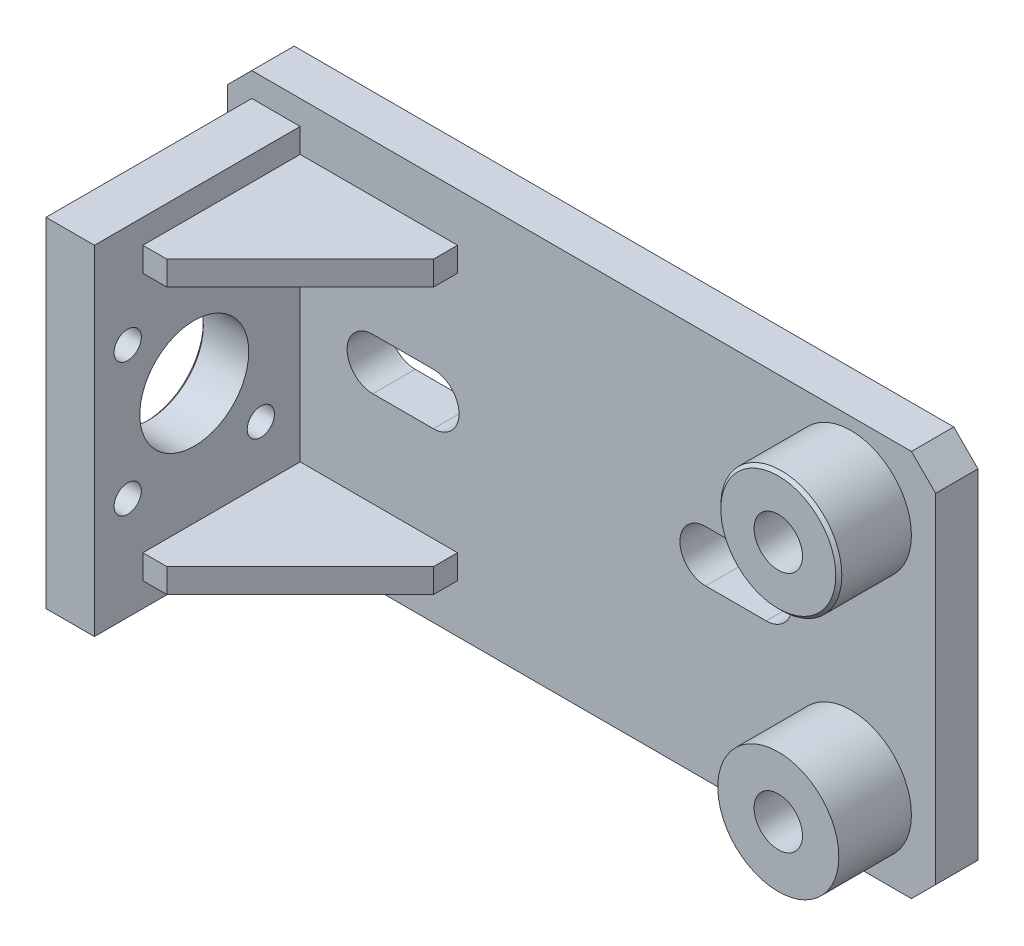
from build123d import *

# Parameters (mm, degrees)
ESQUISSE1_W             = 117
ESQUISSE1_H             = 64
BASE_EXTRUSION_DEPTH    = 7
CHANFREIN1_SIZE         = 4
ESQUISSE2_R             = 10
BOSS_EXTRU_1_DEPTH      = 12
CHANFREIN3_SIZE         = 0.5
ESQUISSE5_R             = 10
BOSS_EXTRU_4_DEPTH      = 12
ESQUISSE7_W             = 8
ESQUISSE7_H             = 56
BOSS_EXTRU_7_DEPTH      = 34
ESQUISSE10_W            = 26
ESQUISSE10_H            = 4
BOSS_EXTRU_9_DEPTH      = 26
CHANFREIN6_SIZE         = 22
ESQUISSE12_W            = 26
ESQUISSE12_H            = 4
BOSS_EXTRU_11_DEPTH     = 26
CHANFREIN7_SIZE         = 22
ESQUISSE13_R            = 9
ENL_V_MAT_EXTRU_1_DEPTH = 118.175082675
CHANFREIN8_SIZE         = 0.5
ESQUISSE3_R             = 4
ENL_V_MAT_EXTRU_2_DEPTH = 98.103038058
ESQUISSE6_R             = 4
ENL_V_MAT_EXTRU_3_DEPTH = 115.893630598
ESQUISSE14_R            = 2.25
ENL_V_MAT_EXTRU_4_DEPTH = 10
ENL_V_MAT_EXTRU_5_DEPTH = 10


with BuildPart() as part:
    # Esquisse1 → Base-Extrusion (new body)
    with BuildSketch(Plane.XY):
        with Locations((-30.5, 0)):
            Rectangle(ESQUISSE1_W, ESQUISSE1_H)
    extrude(amount=BASE_EXTRUSION_DEPTH)

    # Chanfrein1
    chanfrein1_edges = [part.edges().sort_by_distance(p)[0] for p in [
        (-89, 32, 3.5),
        (28, 32, 3.5),
        (28, -32, 3.5),
        (-89, -32, 3.5),
    ]]
    chamfer(chanfrein1_edges, length=CHANFREIN1_SIZE)

    # Esquisse2 → Boss.-Extru.1 (add)
    with BuildSketch(Plane.XY.offset(7)):
        with Locations((14, 20)):
            Circle(ESQUISSE2_R)
    extrude(amount=BOSS_EXTRU_1_DEPTH)

    # Chanfrein3
    chanfrein3_edges = [part.edges().sort_by_distance(p)[0] for p in [
        (4, 20, 19),
    ]]
    chamfer(chanfrein3_edges, length=CHANFREIN3_SIZE)

    # Esquisse5 → Boss.-Extru.4 (add)
    with BuildSketch(Plane(origin=(2.388625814, -32.120396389, 7), x_dir=(1, 0, 0), z_dir=(0, 0, 1))):
        with Locations((11.611374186, 12.120396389)):
            Circle(ESQUISSE5_R)
    extrude(amount=BOSS_EXTRU_4_DEPTH)

    # Esquisse7 → Boss.-Extru.7 (add)
    with BuildSketch(Plane.XY.offset(7)):
        with Locations((-81, 0)):
            Rectangle(ESQUISSE7_W, ESQUISSE7_H)
    extrude(amount=BOSS_EXTRU_7_DEPTH)

    # Esquisse10 → Boss.-Extru.9 (add)
    with BuildSketch(Plane(origin=(-77, 0, 0), x_dir=(0, 0, -1), z_dir=(1, 0, 0))):
        with Locations((-20, -22)):
            Rectangle(ESQUISSE10_W, ESQUISSE10_H)
    extrude(amount=BOSS_EXTRU_9_DEPTH)

    # Chanfrein6
    chanfrein6_edges = [part.edges().sort_by_distance(p)[0] for p in [
        (-51, -22, 33),
    ]]
    chamfer(chanfrein6_edges, length=CHANFREIN6_SIZE)

    # Esquisse12 → Boss.-Extru.11 (add)
    with BuildSketch(Plane(origin=(-77, 31.797692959, 13.355678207), x_dir=(0, 0, -1), z_dir=(1, 0, 0))):
        with Locations((-6.644321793, -9.797692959)):
            Rectangle(ESQUISSE12_W, ESQUISSE12_H)
    extrude(amount=BOSS_EXTRU_11_DEPTH)

    # Chanfrein7
    chanfrein7_edges = [part.edges().sort_by_distance(p)[0] for p in [
        (-51, 22, 33),
    ]]
    chamfer(chanfrein7_edges, length=CHANFREIN7_SIZE)

    # Esquisse13 → Enl_v. mat.-Extru.1 (cut, through all)
    with BuildSketch(Plane(origin=(-77, 0, 0), x_dir=(0, 0, -1), z_dir=(1, 0, 0))):
        with Locations((-24.5, 0)):
            Circle(ESQUISSE13_R)
    extrude(amount=-ENL_V_MAT_EXTRU_1_DEPTH, mode=Mode.SUBTRACT)

    # Chanfrein8
    chanfrein8_edges = [part.edges().sort_by_distance(p)[0] for p in [
        (-85, 0, 33.5),
    ]]
    chamfer(chanfrein8_edges, length=CHANFREIN8_SIZE)

    # Esquisse3 → Enl_v. mat.-Extru.2 (cut, through all)
    with BuildSketch(Plane.XY.offset(19)):
        with Locations((14, 20)):
            Circle(ESQUISSE3_R)
    extrude(amount=-ENL_V_MAT_EXTRU_2_DEPTH, mode=Mode.SUBTRACT)

    # Esquisse6 → Enl_v. mat.-Extru.3 (cut, through all)
    with BuildSketch(Plane(origin=(6.243462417, -28.375733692, 19), x_dir=(1, 0, 0), z_dir=(0, 0, 1))):
        with Locations((7.756537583, 8.375733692)):
            Circle(ESQUISSE6_R)
    extrude(amount=-ENL_V_MAT_EXTRU_3_DEPTH, mode=Mode.SUBTRACT)

    # Esquisse14 → Enl_v. mat.-Extru.4 (cut)
    with BuildSketch(Plane.ZY.offset(85)):
        with Locations((35.5, 11)):
            Circle(ESQUISSE14_R)
        with Locations((13.5, 11)):
            Circle(ESQUISSE14_R)
        with Locations((13.5, -11)):
            Circle(ESQUISSE14_R)
        with Locations((35.5, -11)):
            Circle(ESQUISSE14_R)
    extrude(amount=-ENL_V_MAT_EXTRU_4_DEPTH, mode=Mode.SUBTRACT)

    # Esquisse15 → Enl_v. mat.-Extru.5 (cut)
    with BuildSketch(Plane.XY.offset(7)):
        with BuildLine():
            Line((-10, 4.25), (0, 4.25))
            ThreePointArc((0, 4.25), (4.25, 0), (0, -4.25))
            Line((0, -4.25), (-10, -4.25))
            ThreePointArc((-10, -4.25), (-14.25, 0), (-10, 4.25))
        make_face()
        with BuildLine():
            Line((-65, 4.25), (-55, 4.25))
            ThreePointArc((-55, 4.25), (-50.75, 0), (-55, -4.25))
            Line((-55, -4.25), (-65, -4.25))
            ThreePointArc((-65, -4.25), (-69.25, 0), (-65, 4.25))
        make_face()
    extrude(amount=-ENL_V_MAT_EXTRU_5_DEPTH, mode=Mode.SUBTRACT)


solid = part.part
